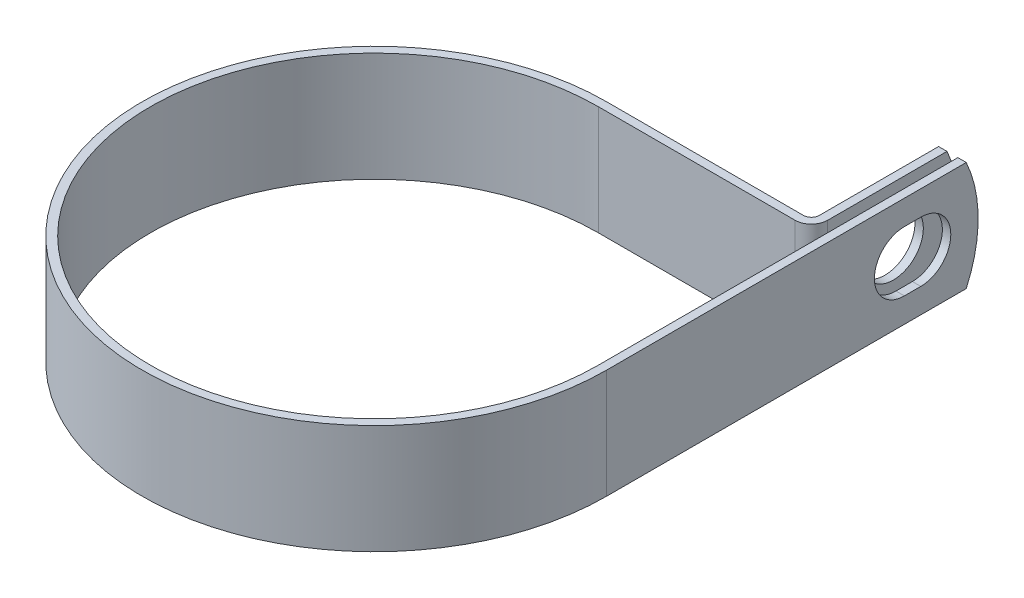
ISO-10303-21;
HEADER;
FILE_DESCRIPTION(('STEP AP214'),'2;1');
FILE_NAME('part.step','',(''),(''),'','','');
FILE_SCHEMA(('AUTOMOTIVE_DESIGN { 1 0 10303 214 1 1 1 1 }'));
ENDSEC;
DATA;
#1=APPLICATION_CONTEXT('core data for automotive mechanical design processes');
#2=APPLICATION_PROTOCOL_DEFINITION('international standard','automotive_design',2000,#1);
#3=PRODUCT_CONTEXT('',#1,'mechanical');
#4=PRODUCT('Part','Part','',(#3));
#5=PRODUCT_RELATED_PRODUCT_CATEGORY('part','',(#4));
#6=PRODUCT_DEFINITION_FORMATION('','',#4);
#7=PRODUCT_DEFINITION_CONTEXT('part definition',#1,'design');
#8=PRODUCT_DEFINITION('design','',#6,#7);
#9=PRODUCT_DEFINITION_SHAPE('','',#8);
#10=(LENGTH_UNIT() NAMED_UNIT(*) SI_UNIT(.MILLI.,.METRE.));
#11=(NAMED_UNIT(*) PLANE_ANGLE_UNIT() SI_UNIT($,.RADIAN.));
#12=(NAMED_UNIT(*) SI_UNIT($,.STERADIAN.) SOLID_ANGLE_UNIT());
#13=UNCERTAINTY_MEASURE_WITH_UNIT(LENGTH_MEASURE(1.E-05),#10,'distance_accuracy_value','');
#14=(GEOMETRIC_REPRESENTATION_CONTEXT(3) GLOBAL_UNCERTAINTY_ASSIGNED_CONTEXT((#13)) GLOBAL_UNIT_ASSIGNED_CONTEXT((#10,
#11,#12)) REPRESENTATION_CONTEXT('',''));
#15=CARTESIAN_POINT('',(0.,0.,0.));
#16=DIRECTION('',(0.,0.,1.));
#17=DIRECTION('',(1.,0.,0.));
#18=AXIS2_PLACEMENT_3D('',#15,#16,#17);
#19=CARTESIAN_POINT('',(32.5374,7.9375,0.));
#20=DIRECTION('',(-1.,0.,0.));
#21=DIRECTION('',(0.,0.,1.));
#22=AXIS2_PLACEMENT_3D('',#19,#20,#21);
#23=PLANE('',#22);
#24=DIRECTION('',(0.,0.,-1.));
#25=VECTOR('',#24,1.);
#26=CARTESIAN_POINT('',(32.5374,-4.3561,-43.2561999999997));
#27=LINE('',#26,#25);
#28=CARTESIAN_POINT('',(32.5374,-4.3561,-43.2561999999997));
#29=VERTEX_POINT('',#28);
#30=CARTESIAN_POINT('',(32.5374,-4.3561,-45.6438000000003));
#31=VERTEX_POINT('',#30);
#32=EDGE_CURVE('E236',#29,#31,#27,.T.);
#33=ORIENTED_EDGE('',*,*,#32,.T.);
#34=CARTESIAN_POINT('',(32.5374,0.,-45.6437999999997));
#35=DIRECTION('',(-1.,0.,0.));
#36=DIRECTION('',(0.,0.,1.));
#37=AXIS2_PLACEMENT_3D('',#34,#35,#36);
#38=CIRCLE('',#37,4.3561);
#39=CARTESIAN_POINT('',(32.5374,4.3561,-45.6438000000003));
#40=VERTEX_POINT('',#39);
#41=EDGE_CURVE('E257',#31,#40,#38,.F.);
#42=ORIENTED_EDGE('',*,*,#41,.T.);
#43=DIRECTION('',(0.,0.,1.));
#44=VECTOR('',#43,1.);
#45=CARTESIAN_POINT('',(32.5374,4.3561,-43.2561999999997));
#46=LINE('',#45,#44);
#47=CARTESIAN_POINT('',(32.5374,4.3561,-43.2561999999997));
#48=VERTEX_POINT('',#47);
#49=EDGE_CURVE('E253',#40,#48,#46,.T.);
#50=ORIENTED_EDGE('',*,*,#49,.T.);
#51=CARTESIAN_POINT('',(32.5374,0.,-43.2561999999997));
#52=DIRECTION('',(-1.,0.,0.));
#53=DIRECTION('',(0.,0.,1.));
#54=AXIS2_PLACEMENT_3D('',#51,#52,#53);
#55=CIRCLE('',#54,4.3561);
#56=EDGE_CURVE('E248',#48,#29,#55,.F.);
#57=ORIENTED_EDGE('',*,*,#56,.T.);
#58=EDGE_LOOP('',(#33,#42,#50,#57));
#59=FACE_BOUND('',#58,.T.);
#60=CARTESIAN_POINT('',(32.5374,0.,-34.925));
#61=DIRECTION('',(-1.,0.,0.));
#62=DIRECTION('',(0.,0.,1.));
#63=AXIS2_PLACEMENT_3D('',#60,#61,#62);
#64=CIRCLE('',#63,19.05);
#65=CARTESIAN_POINT('',(32.5374,7.9375,-52.2425804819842));
#66=VERTEX_POINT('',#65);
#67=CARTESIAN_POINT('',(32.5374,-7.9375,-52.2425804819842));
#68=VERTEX_POINT('',#67);
#69=EDGE_CURVE('E75',#66,#68,#64,.T.);
#70=ORIENTED_EDGE('',*,*,#69,.T.);
#71=DIRECTION('',(0.,0.,-1.));
#72=VECTOR('',#71,1.);
#73=CARTESIAN_POINT('',(32.5374,-7.9375,0.));
#74=LINE('',#73,#72);
#75=CARTESIAN_POINT('',(32.5374,-7.9375,0.));
#76=VERTEX_POINT('',#75);
#77=EDGE_CURVE('E271',#76,#68,#74,.T.);
#78=ORIENTED_EDGE('',*,*,#77,.F.);
#79=DIRECTION('',(0.,-1.,0.));
#80=VECTOR('',#79,1.);
#81=CARTESIAN_POINT('',(32.5374,7.9375,0.));
#82=LINE('',#81,#80);
#83=CARTESIAN_POINT('',(32.5374,7.9375,0.));
#84=VERTEX_POINT('',#83);
#85=EDGE_CURVE('E218',#84,#76,#82,.T.);
#86=ORIENTED_EDGE('',*,*,#85,.F.);
#87=DIRECTION('',(0.,0.,-1.));
#88=VECTOR('',#87,1.);
#89=CARTESIAN_POINT('',(32.5374,7.9375,-32.5374));
#90=LINE('',#89,#88);
#91=EDGE_CURVE('E273',#84,#66,#90,.T.);
#92=ORIENTED_EDGE('',*,*,#91,.T.);
#93=EDGE_LOOP('',(#70,#78,#86,#92));
#94=FACE_BOUND('',#93,.T.);
#95=ADVANCED_FACE('F54',(#59,#94),#23,.T.);
#96=CARTESIAN_POINT('',(30.9626,7.9375,-53.975));
#97=DIRECTION('',(1.,0.,0.));
#98=DIRECTION('',(0.,0.,-1.));
#99=AXIS2_PLACEMENT_3D('',#96,#97,#98);
#100=PLANE('',#99);
#101=CARTESIAN_POINT('',(30.9626,0.,-44.45));
#102=DIRECTION('',(1.,0.,0.));
#103=DIRECTION('',(0.,0.,-1.));
#104=AXIS2_PLACEMENT_3D('',#101,#102,#103);
#105=CIRCLE('',#104,4.3561);
#106=CARTESIAN_POINT('',(30.9626,0.,-48.8061));
#107=VERTEX_POINT('',#106);
#108=EDGE_CURVE('E268',#107,#107,#105,.F.);
#109=ORIENTED_EDGE('',*,*,#108,.T.);
#110=EDGE_LOOP('',(#109));
#111=FACE_BOUND('',#110,.T.);
#112=DIRECTION('',(0.,0.,1.));
#113=VECTOR('',#112,1.);
#114=CARTESIAN_POINT('',(30.9626,-7.9375,-53.975));
#115=LINE('',#114,#113);
#116=CARTESIAN_POINT('',(30.9626,-7.9375,-52.2425804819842));
#117=VERTEX_POINT('',#116);
#118=CARTESIAN_POINT('',(30.9626,-7.9375,-34.91484));
#119=VERTEX_POINT('',#118);
#120=EDGE_CURVE('E184',#117,#119,#115,.T.);
#121=ORIENTED_EDGE('',*,*,#120,.F.);
#122=CARTESIAN_POINT('',(30.9626,0.,-34.925));
#123=DIRECTION('',(1.,0.,0.));
#124=DIRECTION('',(0.,0.,-1.));
#125=AXIS2_PLACEMENT_3D('',#122,#123,#124);
#126=CIRCLE('',#125,19.05);
#127=CARTESIAN_POINT('',(30.9626,7.9375,-52.2425804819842));
#128=VERTEX_POINT('',#127);
#129=EDGE_CURVE('E176',#117,#128,#126,.T.);
#130=ORIENTED_EDGE('',*,*,#129,.T.);
#131=DIRECTION('',(0.,0.,1.));
#132=VECTOR('',#131,1.);
#133=CARTESIAN_POINT('',(30.9626,7.9375,-53.975));
#134=LINE('',#133,#132);
#135=CARTESIAN_POINT('',(30.9626,7.9375,-34.91484));
#136=VERTEX_POINT('',#135);
#137=EDGE_CURVE('E224',#128,#136,#134,.T.);
#138=ORIENTED_EDGE('',*,*,#137,.T.);
#139=DIRECTION('',(0.,-1.,0.));
#140=VECTOR('',#139,1.);
#141=CARTESIAN_POINT('',(30.9626,7.9375,-34.91484));
#142=LINE('',#141,#140);
#143=EDGE_CURVE('E211',#136,#119,#142,.T.);
#144=ORIENTED_EDGE('',*,*,#143,.T.);
#145=EDGE_LOOP('',(#121,#130,#138,#144));
#146=FACE_BOUND('',#145,.T.);
#147=ADVANCED_FACE('F226',(#111,#146),#100,.T.);
#148=CARTESIAN_POINT('',(29.7434,7.9375,-53.975));
#149=DIRECTION('',(1.,0.,0.));
#150=DIRECTION('',(0.,0.,-1.));
#151=AXIS2_PLACEMENT_3D('',#148,#149,#150);
#152=PLANE('',#151);
#153=CARTESIAN_POINT('',(29.7434,0.,-44.45));
#154=DIRECTION('',(-1.,0.,0.));
#155=DIRECTION('',(0.,0.,1.));
#156=AXIS2_PLACEMENT_3D('',#153,#154,#155);
#157=CIRCLE('',#156,4.3561);
#158=CARTESIAN_POINT('',(29.7434,0.,-40.0939));
#159=VERTEX_POINT('',#158);
#160=EDGE_CURVE('E265',#159,#159,#157,.T.);
#161=ORIENTED_EDGE('',*,*,#160,.F.);
#162=EDGE_LOOP('',(#161));
#163=FACE_BOUND('',#162,.T.);
#164=CARTESIAN_POINT('',(29.7434,0.,-34.925));
#165=DIRECTION('',(-1.,0.,0.));
#166=DIRECTION('',(0.,0.,1.));
#167=AXIS2_PLACEMENT_3D('',#164,#165,#166);
#168=CIRCLE('',#167,19.05);
#169=CARTESIAN_POINT('',(29.7434,7.9375,-52.2425804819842));
#170=VERTEX_POINT('',#169);
#171=CARTESIAN_POINT('',(29.7434,-7.9375,-52.2425804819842));
#172=VERTEX_POINT('',#171);
#173=EDGE_CURVE('E67',#170,#172,#168,.T.);
#174=ORIENTED_EDGE('',*,*,#173,.T.);
#175=DIRECTION('',(0.,0.,1.));
#176=VECTOR('',#175,1.);
#177=CARTESIAN_POINT('',(29.7434,-7.9375,-53.975));
#178=LINE('',#177,#176);
#179=CARTESIAN_POINT('',(29.7434,-7.9375,-34.91484));
#180=VERTEX_POINT('',#179);
#181=EDGE_CURVE('E167',#172,#180,#178,.T.);
#182=ORIENTED_EDGE('',*,*,#181,.T.);
#183=DIRECTION('',(0.,-1.,0.));
#184=VECTOR('',#183,1.);
#185=CARTESIAN_POINT('',(29.7434,7.9375,-34.91484));
#186=LINE('',#185,#184);
#187=CARTESIAN_POINT('',(29.7434,7.9375,-34.91484));
#188=VERTEX_POINT('',#187);
#189=EDGE_CURVE('E209',#188,#180,#186,.T.);
#190=ORIENTED_EDGE('',*,*,#189,.F.);
#191=DIRECTION('',(0.,0.,1.));
#192=VECTOR('',#191,1.);
#193=CARTESIAN_POINT('',(29.7434,7.9375,-53.975));
#194=LINE('',#193,#192);
#195=EDGE_CURVE('E169',#170,#188,#194,.T.);
#196=ORIENTED_EDGE('',*,*,#195,.F.);
#197=EDGE_LOOP('',(#174,#182,#190,#196));
#198=FACE_BOUND('',#197,.T.);
#199=ADVANCED_FACE('F164',(#163,#198),#152,.F.);
#200=CARTESIAN_POINT('',(33.7566,7.9375,0.));
#201=DIRECTION('',(-1.,0.,0.));
#202=DIRECTION('',(0.,0.,1.));
#203=AXIS2_PLACEMENT_3D('',#200,#201,#202);
#204=PLANE('',#203);
#205=CARTESIAN_POINT('',(33.7566,0.,-45.6437999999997));
#206=DIRECTION('',(1.,0.,0.));
#207=DIRECTION('',(0.,0.,-1.));
#208=AXIS2_PLACEMENT_3D('',#205,#206,#207);
#209=CIRCLE('',#208,4.3561);
#210=CARTESIAN_POINT('',(33.7566,-4.3561,-45.6438000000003));
#211=VERTEX_POINT('',#210);
#212=CARTESIAN_POINT('',(33.7566,4.3561,-45.6438000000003));
#213=VERTEX_POINT('',#212);
#214=EDGE_CURVE('E237',#211,#213,#209,.T.);
#215=ORIENTED_EDGE('',*,*,#214,.F.);
#216=DIRECTION('',(0.,0.,-1.));
#217=VECTOR('',#216,1.);
#218=CARTESIAN_POINT('',(33.7566,-4.3561,-43.2561999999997));
#219=LINE('',#218,#217);
#220=CARTESIAN_POINT('',(33.7566,-4.3561,-43.2561999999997));
#221=VERTEX_POINT('',#220);
#222=EDGE_CURVE('E240',#221,#211,#219,.T.);
#223=ORIENTED_EDGE('',*,*,#222,.F.);
#224=CARTESIAN_POINT('',(33.7566,0.,-43.2561999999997));
#225=DIRECTION('',(1.,0.,0.));
#226=DIRECTION('',(0.,0.,-1.));
#227=AXIS2_PLACEMENT_3D('',#224,#225,#226);
#228=CIRCLE('',#227,4.3561);
#229=CARTESIAN_POINT('',(33.7566,4.3561,-43.2561999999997));
#230=VERTEX_POINT('',#229);
#231=EDGE_CURVE('E230',#230,#221,#228,.T.);
#232=ORIENTED_EDGE('',*,*,#231,.F.);
#233=DIRECTION('',(0.,0.,1.));
#234=VECTOR('',#233,1.);
#235=CARTESIAN_POINT('',(33.7566,4.3561,-43.2561999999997));
#236=LINE('',#235,#234);
#237=EDGE_CURVE('E234',#213,#230,#236,.T.);
#238=ORIENTED_EDGE('',*,*,#237,.F.);
#239=EDGE_LOOP('',(#215,#223,#232,#238));
#240=FACE_BOUND('',#239,.T.);
#241=DIRECTION('',(0.,0.,-1.));
#242=VECTOR('',#241,1.);
#243=CARTESIAN_POINT('',(33.7566,-7.9375,0.));
#244=LINE('',#243,#242);
#245=CARTESIAN_POINT('',(33.7566,-7.9375,0.));
#246=VERTEX_POINT('',#245);
#247=CARTESIAN_POINT('',(33.7566,-7.9375,-52.2425804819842));
#248=VERTEX_POINT('',#247);
#249=EDGE_CURVE('E195',#246,#248,#244,.T.);
#250=ORIENTED_EDGE('',*,*,#249,.T.);
#251=CARTESIAN_POINT('',(33.7566,0.,-34.925));
#252=DIRECTION('',(-1.,0.,0.));
#253=DIRECTION('',(0.,0.,1.));
#254=AXIS2_PLACEMENT_3D('',#251,#252,#253);
#255=CIRCLE('',#254,19.05);
#256=CARTESIAN_POINT('',(33.7566,7.9375,-52.2425804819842));
#257=VERTEX_POINT('',#256);
#258=EDGE_CURVE('E170',#257,#248,#255,.T.);
#259=ORIENTED_EDGE('',*,*,#258,.F.);
#260=DIRECTION('',(0.,0.,-1.));
#261=VECTOR('',#260,1.);
#262=CARTESIAN_POINT('',(33.7566,7.9375,-32.5374));
#263=LINE('',#262,#261);
#264=CARTESIAN_POINT('',(33.7566,7.9375,0.));
#265=VERTEX_POINT('',#264);
#266=EDGE_CURVE('E198',#265,#257,#263,.T.);
#267=ORIENTED_EDGE('',*,*,#266,.F.);
#268=DIRECTION('',(0.,-1.,0.));
#269=VECTOR('',#268,1.);
#270=CARTESIAN_POINT('',(33.7566,7.9375,0.));
#271=LINE('',#270,#269);
#272=EDGE_CURVE('E199',#265,#246,#271,.T.);
#273=ORIENTED_EDGE('',*,*,#272,.T.);
#274=EDGE_LOOP('',(#250,#259,#267,#273));
#275=FACE_BOUND('',#274,.T.);
#276=ADVANCED_FACE('F321',(#240,#275),#204,.F.);
#277=CARTESIAN_POINT('',(0.,-7.9375,0.));
#278=DIRECTION('',(0.,1.,0.));
#279=DIRECTION('',(1.,0.,0.));
#280=AXIS2_PLACEMENT_3D('',#277,#278,#279);
#281=PLANE('',#280);
#282=DIRECTION('',(-1.,0.,0.));
#283=VECTOR('',#282,1.);
#284=CARTESIAN_POINT('',(33.7566,-7.9375,-52.2425804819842));
#285=LINE('',#284,#283);
#286=EDGE_CURVE('E171',#248,#68,#285,.T.);
#287=ORIENTED_EDGE('',*,*,#286,.F.);
#288=ORIENTED_EDGE('',*,*,#249,.F.);
#289=CARTESIAN_POINT('',(0.,-7.9375,0.));
#290=DIRECTION('',(0.,1.,0.));
#291=DIRECTION('',(1.,0.,0.));
#292=AXIS2_PLACEMENT_3D('',#289,#290,#291);
#293=CIRCLE('',#292,33.7566);
#294=CARTESIAN_POINT('',(0.,-7.9375,-33.7566));
#295=VERTEX_POINT('',#294);
#296=EDGE_CURVE('E193',#295,#246,#293,.T.);
#297=ORIENTED_EDGE('',*,*,#296,.F.);
#298=DIRECTION('',(1.,0.,0.));
#299=VECTOR('',#298,1.);
#300=CARTESIAN_POINT('',(0.,-7.9375,-33.7566));
#301=LINE('',#300,#299);
#302=CARTESIAN_POINT('',(28.58516,-7.9375,-33.7566));
#303=VERTEX_POINT('',#302);
#304=EDGE_CURVE('E186',#303,#295,#301,.F.);
#305=ORIENTED_EDGE('',*,*,#304,.F.);
#306=CARTESIAN_POINT('',(28.58516,-7.9375,-34.91484));
#307=DIRECTION('',(0.,1.,0.));
#308=DIRECTION('',(1.,0.,0.));
#309=AXIS2_PLACEMENT_3D('',#306,#307,#308);
#310=CIRCLE('',#309,1.15824);
#311=EDGE_CURVE('E183',#180,#303,#310,.F.);
#312=ORIENTED_EDGE('',*,*,#311,.F.);
#313=ORIENTED_EDGE('',*,*,#181,.F.);
#314=DIRECTION('',(-1.,0.,0.));
#315=VECTOR('',#314,1.);
#316=CARTESIAN_POINT('',(33.7566,-7.9375,-52.2425804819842));
#317=LINE('',#316,#315);
#318=EDGE_CURVE('E12',#117,#172,#317,.T.);
#319=ORIENTED_EDGE('',*,*,#318,.F.);
#320=ORIENTED_EDGE('',*,*,#120,.T.);
#321=CARTESIAN_POINT('',(28.58516,-7.9375,-34.91484));
#322=DIRECTION('',(0.,-1.,0.));
#323=DIRECTION('',(0.,0.,1.));
#324=AXIS2_PLACEMENT_3D('',#321,#322,#323);
#325=CIRCLE('',#324,2.37744);
#326=CARTESIAN_POINT('',(28.58516,-7.9375,-32.5374));
#327=VERTEX_POINT('',#326);
#328=EDGE_CURVE('E188',#119,#327,#325,.T.);
#329=ORIENTED_EDGE('',*,*,#328,.T.);
#330=DIRECTION('',(-1.,0.,0.));
#331=VECTOR('',#330,1.);
#332=CARTESIAN_POINT('',(0.,-7.9375,-32.5374));
#333=LINE('',#332,#331);
#334=CARTESIAN_POINT('',(0.,-7.9375,-32.5374));
#335=VERTEX_POINT('',#334);
#336=EDGE_CURVE('E298',#327,#335,#333,.T.);
#337=ORIENTED_EDGE('',*,*,#336,.T.);
#338=CARTESIAN_POINT('',(0.,-7.9375,0.));
#339=DIRECTION('',(0.,1.,0.));
#340=DIRECTION('',(0.,0.,1.));
#341=AXIS2_PLACEMENT_3D('',#338,#339,#340);
#342=CIRCLE('',#341,32.5374);
#343=EDGE_CURVE('E295',#335,#76,#342,.T.);
#344=ORIENTED_EDGE('',*,*,#343,.T.);
#345=ORIENTED_EDGE('',*,*,#77,.T.);
#346=EDGE_LOOP('',(#287,#288,#297,#305,#312,#313,#319,#320,#329,#337,#344,#345));
#347=FACE_BOUND('',#346,.T.);
#348=ADVANCED_FACE('F181',(#347),#281,.F.);
#349=CARTESIAN_POINT('',(0.,7.9375,0.));
#350=DIRECTION('',(0.,1.,0.));
#351=DIRECTION('',(1.,0.,0.));
#352=AXIS2_PLACEMENT_3D('',#349,#350,#351);
#353=PLANE('',#352);
#354=ORIENTED_EDGE('',*,*,#266,.T.);
#355=DIRECTION('',(-1.,0.,0.));
#356=VECTOR('',#355,1.);
#357=CARTESIAN_POINT('',(33.7566,7.9375,-52.2425804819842));
#358=LINE('',#357,#356);
#359=EDGE_CURVE('E228',#257,#66,#358,.T.);
#360=ORIENTED_EDGE('',*,*,#359,.T.);
#361=ORIENTED_EDGE('',*,*,#91,.F.);
#362=CARTESIAN_POINT('',(0.,7.9375,0.));
#363=DIRECTION('',(0.,1.,0.));
#364=DIRECTION('',(0.,0.,1.));
#365=AXIS2_PLACEMENT_3D('',#362,#363,#364);
#366=CIRCLE('',#365,32.5374);
#367=CARTESIAN_POINT('',(0.,7.9375,-32.5374));
#368=VERTEX_POINT('',#367);
#369=EDGE_CURVE('E276',#368,#84,#366,.T.);
#370=ORIENTED_EDGE('',*,*,#369,.F.);
#371=DIRECTION('',(-1.,0.,0.));
#372=VECTOR('',#371,1.);
#373=CARTESIAN_POINT('',(0.,7.9375,-32.5374));
#374=LINE('',#373,#372);
#375=CARTESIAN_POINT('',(28.58516,7.9375,-32.5374));
#376=VERTEX_POINT('',#375);
#377=EDGE_CURVE('E279',#376,#368,#374,.T.);
#378=ORIENTED_EDGE('',*,*,#377,.F.);
#379=CARTESIAN_POINT('',(28.58516,7.9375,-34.91484));
#380=DIRECTION('',(0.,-1.,0.));
#381=DIRECTION('',(0.,0.,1.));
#382=AXIS2_PLACEMENT_3D('',#379,#380,#381);
#383=CIRCLE('',#382,2.37744);
#384=EDGE_CURVE('E282',#136,#376,#383,.T.);
#385=ORIENTED_EDGE('',*,*,#384,.F.);
#386=ORIENTED_EDGE('',*,*,#137,.F.);
#387=DIRECTION('',(-1.,0.,0.));
#388=VECTOR('',#387,1.);
#389=CARTESIAN_POINT('',(33.7566,7.9375,-52.2425804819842));
#390=LINE('',#389,#388);
#391=EDGE_CURVE('E61',#128,#170,#390,.T.);
#392=ORIENTED_EDGE('',*,*,#391,.T.);
#393=ORIENTED_EDGE('',*,*,#195,.T.);
#394=CARTESIAN_POINT('',(28.58516,7.9375,-34.91484));
#395=DIRECTION('',(0.,1.,0.));
#396=DIRECTION('',(1.,0.,0.));
#397=AXIS2_PLACEMENT_3D('',#394,#395,#396);
#398=CIRCLE('',#397,1.15824);
#399=CARTESIAN_POINT('',(28.58516,7.9375,-33.7566));
#400=VERTEX_POINT('',#399);
#401=EDGE_CURVE('E287',#188,#400,#398,.F.);
#402=ORIENTED_EDGE('',*,*,#401,.T.);
#403=DIRECTION('',(1.,0.,0.));
#404=VECTOR('',#403,1.);
#405=CARTESIAN_POINT('',(0.,7.9375,-33.7566));
#406=LINE('',#405,#404);
#407=CARTESIAN_POINT('',(0.,7.9375,-33.7566));
#408=VERTEX_POINT('',#407);
#409=EDGE_CURVE('E289',#400,#408,#406,.F.);
#410=ORIENTED_EDGE('',*,*,#409,.T.);
#411=CARTESIAN_POINT('',(0.,7.9375,0.));
#412=DIRECTION('',(0.,1.,0.));
#413=DIRECTION('',(1.,0.,0.));
#414=AXIS2_PLACEMENT_3D('',#411,#412,#413);
#415=CIRCLE('',#414,33.7566);
#416=EDGE_CURVE('E203',#408,#265,#415,.T.);
#417=ORIENTED_EDGE('',*,*,#416,.T.);
#418=EDGE_LOOP('',(#354,#360,#361,#370,#378,#385,#386,#392,#393,#402,#410,#417));
#419=FACE_BOUND('',#418,.T.);
#420=ADVANCED_FACE('F222',(#419),#353,.T.);
#421=CARTESIAN_POINT('',(0.,7.9375,0.));
#422=DIRECTION('',(0.,-1.,0.));
#423=DIRECTION('',(0.,0.,-1.));
#424=AXIS2_PLACEMENT_3D('',#421,#422,#423);
#425=CYLINDRICAL_SURFACE('',#424,32.5374);
#426=ORIENTED_EDGE('',*,*,#343,.F.);
#427=DIRECTION('',(0.,-1.,0.));
#428=VECTOR('',#427,1.);
#429=CARTESIAN_POINT('',(0.,7.9375,-32.5374));
#430=LINE('',#429,#428);
#431=EDGE_CURVE('E216',#368,#335,#430,.T.);
#432=ORIENTED_EDGE('',*,*,#431,.F.);
#433=ORIENTED_EDGE('',*,*,#369,.T.);
#434=ORIENTED_EDGE('',*,*,#85,.T.);
#435=EDGE_LOOP('',(#426,#432,#433,#434));
#436=FACE_BOUND('',#435,.T.);
#437=ADVANCED_FACE('F311',(#436),#425,.F.);
#438=CARTESIAN_POINT('',(0.,7.9375,-32.5374));
#439=DIRECTION('',(0.,0.,1.));
#440=DIRECTION('',(1.,0.,0.));
#441=AXIS2_PLACEMENT_3D('',#438,#439,#440);
#442=PLANE('',#441);
#443=ORIENTED_EDGE('',*,*,#336,.F.);
#444=DIRECTION('',(0.,-1.,0.));
#445=VECTOR('',#444,1.);
#446=CARTESIAN_POINT('',(28.58516,7.9375,-32.5374));
#447=LINE('',#446,#445);
#448=EDGE_CURVE('E214',#376,#327,#447,.T.);
#449=ORIENTED_EDGE('',*,*,#448,.F.);
#450=ORIENTED_EDGE('',*,*,#377,.T.);
#451=ORIENTED_EDGE('',*,*,#431,.T.);
#452=EDGE_LOOP('',(#443,#449,#450,#451));
#453=FACE_BOUND('',#452,.T.);
#454=ADVANCED_FACE('F307',(#453),#442,.T.);
#455=CARTESIAN_POINT('',(28.58516,7.9375,-34.91484));
#456=DIRECTION('',(0.,-1.,0.));
#457=DIRECTION('',(0.,0.,-1.));
#458=AXIS2_PLACEMENT_3D('',#455,#456,#457);
#459=CYLINDRICAL_SURFACE('',#458,2.37744);
#460=ORIENTED_EDGE('',*,*,#328,.F.);
#461=ORIENTED_EDGE('',*,*,#143,.F.);
#462=ORIENTED_EDGE('',*,*,#384,.T.);
#463=ORIENTED_EDGE('',*,*,#448,.T.);
#464=EDGE_LOOP('',(#460,#461,#462,#463));
#465=FACE_BOUND('',#464,.T.);
#466=ADVANCED_FACE('F304',(#465),#459,.T.);
#467=CARTESIAN_POINT('',(28.58516,7.9375,-34.91484));
#468=DIRECTION('',(0.,-1.,0.));
#469=DIRECTION('',(0.,0.,-1.));
#470=AXIS2_PLACEMENT_3D('',#467,#468,#469);
#471=CYLINDRICAL_SURFACE('',#470,1.15824);
#472=ORIENTED_EDGE('',*,*,#311,.T.);
#473=DIRECTION('',(0.,-1.,0.));
#474=VECTOR('',#473,1.);
#475=CARTESIAN_POINT('',(28.58516,7.9375,-33.7566));
#476=LINE('',#475,#474);
#477=EDGE_CURVE('E206',#400,#303,#476,.T.);
#478=ORIENTED_EDGE('',*,*,#477,.F.);
#479=ORIENTED_EDGE('',*,*,#401,.F.);
#480=ORIENTED_EDGE('',*,*,#189,.T.);
#481=EDGE_LOOP('',(#472,#478,#479,#480));
#482=FACE_BOUND('',#481,.T.);
#483=ADVANCED_FACE('F334',(#482),#471,.F.);
#484=CARTESIAN_POINT('',(0.,7.9375,-33.7566));
#485=DIRECTION('',(0.,0.,1.));
#486=DIRECTION('',(1.,0.,0.));
#487=AXIS2_PLACEMENT_3D('',#484,#485,#486);
#488=PLANE('',#487);
#489=ORIENTED_EDGE('',*,*,#304,.T.);
#490=DIRECTION('',(0.,-1.,0.));
#491=VECTOR('',#490,1.);
#492=CARTESIAN_POINT('',(0.,7.9375,-33.7566));
#493=LINE('',#492,#491);
#494=EDGE_CURVE('E202',#408,#295,#493,.T.);
#495=ORIENTED_EDGE('',*,*,#494,.F.);
#496=ORIENTED_EDGE('',*,*,#409,.F.);
#497=ORIENTED_EDGE('',*,*,#477,.T.);
#498=EDGE_LOOP('',(#489,#495,#496,#497));
#499=FACE_BOUND('',#498,.T.);
#500=ADVANCED_FACE('F330',(#499),#488,.F.);
#501=CARTESIAN_POINT('',(0.,7.9375,0.));
#502=DIRECTION('',(0.,-1.,0.));
#503=DIRECTION('',(0.,0.,-1.));
#504=AXIS2_PLACEMENT_3D('',#501,#502,#503);
#505=CYLINDRICAL_SURFACE('',#504,33.7566);
#506=ORIENTED_EDGE('',*,*,#296,.T.);
#507=ORIENTED_EDGE('',*,*,#272,.F.);
#508=ORIENTED_EDGE('',*,*,#416,.F.);
#509=ORIENTED_EDGE('',*,*,#494,.T.);
#510=EDGE_LOOP('',(#506,#507,#508,#509));
#511=FACE_BOUND('',#510,.T.);
#512=ADVANCED_FACE('F327',(#511),#505,.T.);
#513=CARTESIAN_POINT('',(43.2835113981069,0.,-44.45));
#514=DIRECTION('',(-1.,0.,0.));
#515=DIRECTION('',(0.,0.,1.));
#516=AXIS2_PLACEMENT_3D('',#513,#514,#515);
#517=CYLINDRICAL_SURFACE('',#516,4.3561);
#518=ORIENTED_EDGE('',*,*,#160,.T.);
#519=EDGE_LOOP('',(#518));
#520=FACE_BOUND('',#519,.T.);
#521=ORIENTED_EDGE('',*,*,#108,.F.);
#522=EDGE_LOOP('',(#521));
#523=FACE_BOUND('',#522,.T.);
#524=ADVANCED_FACE('F379',(#520,#523),#517,.F.);
#525=CARTESIAN_POINT('',(18.4268369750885,-4.3561,-43.2561999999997));
#526=DIRECTION('',(0.,-1.,0.));
#527=DIRECTION('',(0.,0.,-1.));
#528=AXIS2_PLACEMENT_3D('',#525,#526,#527);
#529=PLANE('',#528);
#530=DIRECTION('',(1.,0.,0.));
#531=VECTOR('',#530,1.);
#532=CARTESIAN_POINT('',(18.4268369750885,-4.3561,-43.2561999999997));
#533=LINE('',#532,#531);
#534=EDGE_CURVE('E251',#29,#221,#533,.T.);
#535=ORIENTED_EDGE('',*,*,#534,.T.);
#536=ORIENTED_EDGE('',*,*,#222,.T.);
#537=DIRECTION('',(1.,0.,0.));
#538=VECTOR('',#537,1.);
#539=CARTESIAN_POINT('',(18.4268369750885,-4.3561,-45.6438000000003));
#540=LINE('',#539,#538);
#541=EDGE_CURVE('E247',#31,#211,#540,.T.);
#542=ORIENTED_EDGE('',*,*,#541,.F.);
#543=ORIENTED_EDGE('',*,*,#32,.F.);
#544=EDGE_LOOP('',(#535,#536,#542,#543));
#545=FACE_BOUND('',#544,.T.);
#546=ADVANCED_FACE('F354',(#545),#529,.F.);
#547=CARTESIAN_POINT('',(18.4268369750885,0.,-45.6437999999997));
#548=DIRECTION('',(1.,0.,0.));
#549=DIRECTION('',(0.,0.,-1.));
#550=AXIS2_PLACEMENT_3D('',#547,#548,#549);
#551=CYLINDRICAL_SURFACE('',#550,4.3561);
#552=ORIENTED_EDGE('',*,*,#541,.T.);
#553=ORIENTED_EDGE('',*,*,#214,.T.);
#554=DIRECTION('',(1.,0.,0.));
#555=VECTOR('',#554,1.);
#556=CARTESIAN_POINT('',(18.4268369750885,4.3561,-45.6438000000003));
#557=LINE('',#556,#555);
#558=EDGE_CURVE('E256',#40,#213,#557,.T.);
#559=ORIENTED_EDGE('',*,*,#558,.F.);
#560=ORIENTED_EDGE('',*,*,#41,.F.);
#561=EDGE_LOOP('',(#552,#553,#559,#560));
#562=FACE_BOUND('',#561,.T.);
#563=ADVANCED_FACE('F358',(#562),#551,.F.);
#564=CARTESIAN_POINT('',(18.4268369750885,4.3561,-43.2561999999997));
#565=DIRECTION('',(0.,1.,0.));
#566=DIRECTION('',(0.,0.,1.));
#567=AXIS2_PLACEMENT_3D('',#564,#565,#566);
#568=PLANE('',#567);
#569=ORIENTED_EDGE('',*,*,#558,.T.);
#570=ORIENTED_EDGE('',*,*,#237,.T.);
#571=DIRECTION('',(1.,0.,0.));
#572=VECTOR('',#571,1.);
#573=CARTESIAN_POINT('',(18.4268369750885,4.3561,-43.2561999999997));
#574=LINE('',#573,#572);
#575=EDGE_CURVE('E252',#48,#230,#574,.T.);
#576=ORIENTED_EDGE('',*,*,#575,.F.);
#577=ORIENTED_EDGE('',*,*,#49,.F.);
#578=EDGE_LOOP('',(#569,#570,#576,#577));
#579=FACE_BOUND('',#578,.T.);
#580=ADVANCED_FACE('F362',(#579),#568,.F.);
#581=CARTESIAN_POINT('',(18.4268369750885,0.,-43.2561999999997));
#582=DIRECTION('',(1.,0.,0.));
#583=DIRECTION('',(0.,0.,-1.));
#584=AXIS2_PLACEMENT_3D('',#581,#582,#583);
#585=CYLINDRICAL_SURFACE('',#584,4.3561);
#586=ORIENTED_EDGE('',*,*,#575,.T.);
#587=ORIENTED_EDGE('',*,*,#231,.T.);
#588=ORIENTED_EDGE('',*,*,#534,.F.);
#589=ORIENTED_EDGE('',*,*,#56,.F.);
#590=EDGE_LOOP('',(#586,#587,#588,#589));
#591=FACE_BOUND('',#590,.T.);
#592=ADVANCED_FACE('F366',(#591),#585,.F.);
#593=CARTESIAN_POINT('',(33.7566,0.,-34.925));
#594=DIRECTION('',(-1.,0.,0.));
#595=DIRECTION('',(0.,0.,1.));
#596=AXIS2_PLACEMENT_3D('',#593,#594,#595);
#597=CYLINDRICAL_SURFACE('',#596,19.05);
#598=ORIENTED_EDGE('',*,*,#129,.F.);
#599=ORIENTED_EDGE('',*,*,#318,.T.);
#600=ORIENTED_EDGE('',*,*,#173,.F.);
#601=ORIENTED_EDGE('',*,*,#391,.F.);
#602=EDGE_LOOP('',(#598,#599,#600,#601));
#603=FACE_BOUND('',#602,.T.);
#604=ADVANCED_FACE('F174',(#603),#597,.T.);
#605=ORIENTED_EDGE('',*,*,#359,.F.);
#606=ORIENTED_EDGE('',*,*,#258,.T.);
#607=ORIENTED_EDGE('',*,*,#286,.T.);
#608=ORIENTED_EDGE('',*,*,#69,.F.);
#609=EDGE_LOOP('',(#605,#606,#607,#608));
#610=FACE_BOUND('',#609,.T.);
#611=ADVANCED_FACE('F316',(#610),#597,.T.);
#612=CLOSED_SHELL('',(#95,#147,#199,#276,#348,#420,#437,#454,#466,#483,#500,#512,#524,#546,#563,
#580,#592,#604,#611));
#613=MANIFOLD_SOLID_BREP('B2',#612);
#614=ADVANCED_BREP_SHAPE_REPRESENTATION('',(#18,#613),#14);
#615=SHAPE_DEFINITION_REPRESENTATION(#9,#614);
ENDSEC;
END-ISO-10303-21;
